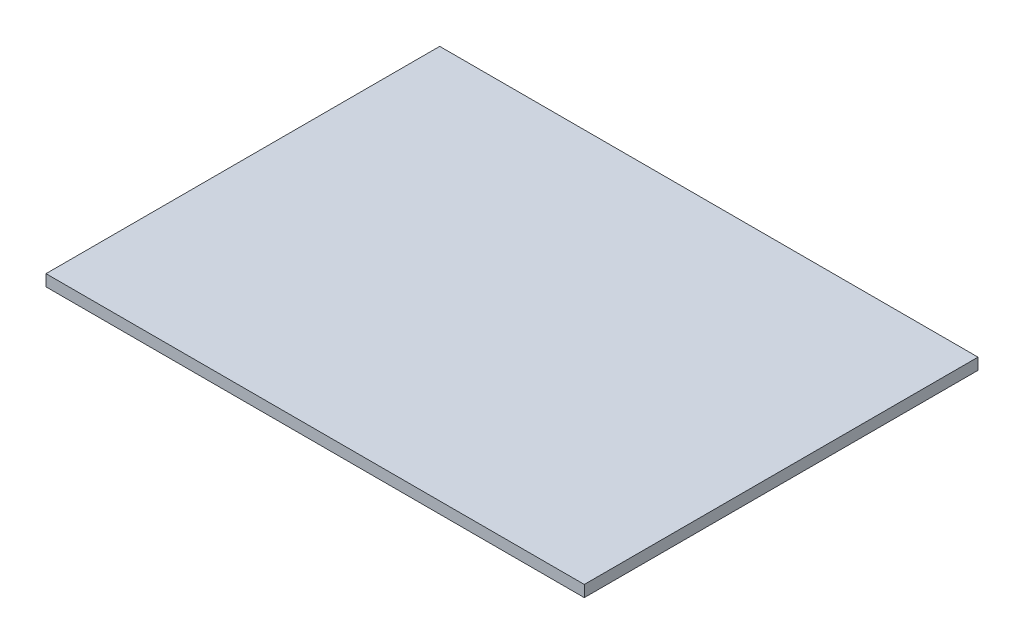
from build123d import *

# Parameters (mm, degrees)
SKETCH2_W           = 55
SKETCH2_H           = 1.6
BOSS_EXTRUDE1_DEPTH = 75.2


with BuildPart() as part:
    # Sketch2 → Boss-Extrude1 (new body)
    with BuildSketch(Plane.ZY.offset(45.85)):
        with Locations((-0.05, 39)):
            Rectangle(SKETCH2_W, SKETCH2_H)
    extrude(amount=-BOSS_EXTRUDE1_DEPTH)


solid = part.part
